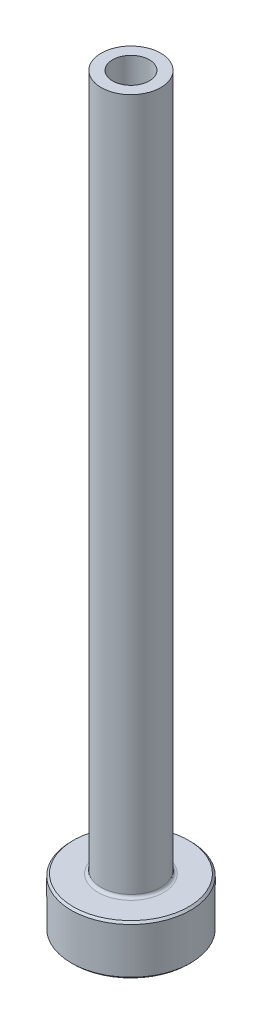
ISO-10303-21;
HEADER;
FILE_DESCRIPTION(('STEP AP214'),'2;1');
FILE_NAME('part.step','',(''),(''),'','','');
FILE_SCHEMA(('AUTOMOTIVE_DESIGN { 1 0 10303 214 1 1 1 1 }'));
ENDSEC;
DATA;
#1=APPLICATION_CONTEXT('core data for automotive mechanical design processes');
#2=APPLICATION_PROTOCOL_DEFINITION('international standard','automotive_design',2000,#1);
#3=PRODUCT_CONTEXT('',#1,'mechanical');
#4=PRODUCT('Part','Part','',(#3));
#5=PRODUCT_RELATED_PRODUCT_CATEGORY('part','',(#4));
#6=PRODUCT_DEFINITION_FORMATION('','',#4);
#7=PRODUCT_DEFINITION_CONTEXT('part definition',#1,'design');
#8=PRODUCT_DEFINITION('design','',#6,#7);
#9=PRODUCT_DEFINITION_SHAPE('','',#8);
#10=(LENGTH_UNIT() NAMED_UNIT(*) SI_UNIT(.MILLI.,.METRE.));
#11=(NAMED_UNIT(*) PLANE_ANGLE_UNIT() SI_UNIT($,.RADIAN.));
#12=(NAMED_UNIT(*) SI_UNIT($,.STERADIAN.) SOLID_ANGLE_UNIT());
#13=UNCERTAINTY_MEASURE_WITH_UNIT(LENGTH_MEASURE(1.E-05),#10,'distance_accuracy_value','');
#14=(GEOMETRIC_REPRESENTATION_CONTEXT(3) GLOBAL_UNCERTAINTY_ASSIGNED_CONTEXT((#13)) GLOBAL_UNIT_ASSIGNED_CONTEXT((#10,
#11,#12)) REPRESENTATION_CONTEXT('',''));
#15=CARTESIAN_POINT('',(0.,0.,0.));
#16=DIRECTION('',(0.,0.,1.));
#17=DIRECTION('',(1.,0.,0.));
#18=AXIS2_PLACEMENT_3D('',#15,#16,#17);
#19=CARTESIAN_POINT('',(0.,92.1876809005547,0.));
#20=DIRECTION('',(0.,1.,0.));
#21=DIRECTION('',(0.,0.,1.));
#22=AXIS2_PLACEMENT_3D('',#19,#20,#21);
#23=CYLINDRICAL_SURFACE('',#22,1.85000000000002);
#24=CARTESIAN_POINT('',(0.,75.,0.));
#25=DIRECTION('',(0.,1.,0.));
#26=DIRECTION('',(0.,0.,1.));
#27=AXIS2_PLACEMENT_3D('',#24,#25,#26);
#28=CIRCLE('',#27,1.85000000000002);
#29=CARTESIAN_POINT('',(0.,75.,1.85000000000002));
#30=VERTEX_POINT('',#29);
#31=EDGE_CURVE('E62',#30,#30,#28,.T.);
#32=ORIENTED_EDGE('',*,*,#31,.T.);
#33=EDGE_LOOP('',(#32));
#34=FACE_BOUND('',#33,.T.);
#35=CARTESIAN_POINT('',(0.,30.,0.));
#36=DIRECTION('',(0.,1.,0.));
#37=DIRECTION('',(0.,0.,1.));
#38=AXIS2_PLACEMENT_3D('',#35,#36,#37);
#39=CIRCLE('',#38,1.85000000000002);
#40=CARTESIAN_POINT('',(0.,30.,1.85000000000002));
#41=VERTEX_POINT('',#40);
#42=EDGE_CURVE('E71',#41,#41,#39,.T.);
#43=ORIENTED_EDGE('',*,*,#42,.F.);
#44=EDGE_LOOP('',(#43));
#45=FACE_BOUND('',#44,.T.);
#46=ADVANCED_FACE('F30',(#34,#45),#23,.F.);
#47=CARTESIAN_POINT('',(-1.85000000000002,75.,0.));
#48=DIRECTION('',(0.,1.,0.));
#49=DIRECTION('',(0.,0.,1.));
#50=AXIS2_PLACEMENT_3D('',#47,#48,#49);
#51=PLANE('',#50);
#52=CARTESIAN_POINT('',(0.,75.,0.));
#53=DIRECTION('',(0.,1.,0.));
#54=DIRECTION('',(0.,0.,1.));
#55=AXIS2_PLACEMENT_3D('',#52,#53,#54);
#56=CIRCLE('',#55,3.);
#57=CARTESIAN_POINT('',(0.,75.,3.));
#58=VERTEX_POINT('',#57);
#59=EDGE_CURVE('E65',#58,#58,#56,.T.);
#60=ORIENTED_EDGE('',*,*,#59,.T.);
#61=EDGE_LOOP('',(#60));
#62=FACE_BOUND('',#61,.T.);
#63=ORIENTED_EDGE('',*,*,#31,.F.);
#64=EDGE_LOOP('',(#63));
#65=FACE_BOUND('',#64,.T.);
#66=ADVANCED_FACE('F79',(#62,#65),#51,.T.);
#67=CARTESIAN_POINT('',(0.,92.1876809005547,0.));
#68=DIRECTION('',(0.,1.,0.));
#69=DIRECTION('',(0.,0.,1.));
#70=AXIS2_PLACEMENT_3D('',#67,#68,#69);
#71=CYLINDRICAL_SURFACE('',#70,2.99999999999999);
#72=CARTESIAN_POINT('',(0.,5.3,0.));
#73=DIRECTION('',(0.,1.,0.));
#74=DIRECTION('',(0.,0.,1.));
#75=AXIS2_PLACEMENT_3D('',#72,#73,#74);
#76=CIRCLE('',#75,2.99999999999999);
#77=CARTESIAN_POINT('',(0.,5.3,2.99999999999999));
#78=VERTEX_POINT('',#77);
#79=EDGE_CURVE('E59',#78,#78,#76,.T.);
#80=ORIENTED_EDGE('',*,*,#79,.T.);
#81=EDGE_LOOP('',(#80));
#82=FACE_BOUND('',#81,.T.);
#83=ORIENTED_EDGE('',*,*,#59,.F.);
#84=EDGE_LOOP('',(#83));
#85=FACE_BOUND('',#84,.T.);
#86=ADVANCED_FACE('F85',(#82,#85),#71,.T.);
#87=CARTESIAN_POINT('',(-2.99999999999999,5.,0.));
#88=DIRECTION('',(0.,1.,0.));
#89=DIRECTION('',(0.,0.,1.));
#90=AXIS2_PLACEMENT_3D('',#87,#88,#89);
#91=PLANE('',#90);
#92=CARTESIAN_POINT('',(0.,5.,0.));
#93=DIRECTION('',(0.,1.,0.));
#94=DIRECTION('',(0.,0.,1.));
#95=AXIS2_PLACEMENT_3D('',#92,#93,#94);
#96=CIRCLE('',#95,5.80000000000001);
#97=CARTESIAN_POINT('',(0.,5.,5.80000000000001));
#98=VERTEX_POINT('',#97);
#99=EDGE_CURVE('E53',#98,#98,#96,.T.);
#100=ORIENTED_EDGE('',*,*,#99,.T.);
#101=EDGE_LOOP('',(#100));
#102=FACE_BOUND('',#101,.T.);
#103=CARTESIAN_POINT('',(0.,5.,0.));
#104=DIRECTION('',(0.,1.,0.));
#105=DIRECTION('',(0.,0.,1.));
#106=AXIS2_PLACEMENT_3D('',#103,#104,#105);
#107=CIRCLE('',#106,3.29999999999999);
#108=CARTESIAN_POINT('',(0.,5.,3.29999999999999));
#109=VERTEX_POINT('',#108);
#110=EDGE_CURVE('E56',#109,#109,#107,.F.);
#111=ORIENTED_EDGE('',*,*,#110,.T.);
#112=EDGE_LOOP('',(#111));
#113=FACE_BOUND('',#112,.T.);
#114=ADVANCED_FACE('F111',(#102,#113),#91,.T.);
#115=CARTESIAN_POINT('',(0.,92.1876809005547,0.));
#116=DIRECTION('',(0.,1.,0.));
#117=DIRECTION('',(0.,0.,1.));
#118=AXIS2_PLACEMENT_3D('',#115,#116,#117);
#119=CYLINDRICAL_SURFACE('',#118,5.99999999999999);
#120=CARTESIAN_POINT('',(0.,4.8,0.));
#121=DIRECTION('',(0.,1.,0.));
#122=DIRECTION('',(0.,0.,1.));
#123=AXIS2_PLACEMENT_3D('',#120,#121,#122);
#124=CIRCLE('',#123,5.99999999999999);
#125=CARTESIAN_POINT('',(0.,4.8,5.99999999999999));
#126=VERTEX_POINT('',#125);
#127=EDGE_CURVE('E45',#126,#126,#124,.F.);
#128=ORIENTED_EDGE('',*,*,#127,.T.);
#129=EDGE_LOOP('',(#128));
#130=FACE_BOUND('',#129,.T.);
#131=CARTESIAN_POINT('',(0.,0.199999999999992,0.));
#132=DIRECTION('',(0.,-1.,0.));
#133=DIRECTION('',(0.,0.,-1.));
#134=AXIS2_PLACEMENT_3D('',#131,#132,#133);
#135=CIRCLE('',#134,5.99999999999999);
#136=CARTESIAN_POINT('',(0.,0.199999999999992,-5.99999999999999));
#137=VERTEX_POINT('',#136);
#138=EDGE_CURVE('E50',#137,#137,#135,.F.);
#139=ORIENTED_EDGE('',*,*,#138,.T.);
#140=EDGE_LOOP('',(#139));
#141=FACE_BOUND('',#140,.T.);
#142=ADVANCED_FACE('F108',(#130,#141),#119,.T.);
#143=CARTESIAN_POINT('',(-5.99999999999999,0.,0.));
#144=DIRECTION('',(0.,-1.,0.));
#145=DIRECTION('',(0.,0.,-1.));
#146=AXIS2_PLACEMENT_3D('',#143,#144,#145);
#147=PLANE('',#146);
#148=CARTESIAN_POINT('',(0.,0.,0.));
#149=DIRECTION('',(0.,-1.,0.));
#150=DIRECTION('',(0.,0.,-1.));
#151=AXIS2_PLACEMENT_3D('',#148,#149,#150);
#152=CIRCLE('',#151,2.59999999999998);
#153=CARTESIAN_POINT('',(0.,0.,-2.59999999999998));
#154=VERTEX_POINT('',#153);
#155=EDGE_CURVE('E37',#154,#154,#152,.F.);
#156=ORIENTED_EDGE('',*,*,#155,.T.);
#157=EDGE_LOOP('',(#156));
#158=FACE_BOUND('',#157,.T.);
#159=CARTESIAN_POINT('',(0.,0.,0.));
#160=DIRECTION('',(0.,-1.,0.));
#161=DIRECTION('',(0.,0.,-1.));
#162=AXIS2_PLACEMENT_3D('',#159,#160,#161);
#163=CIRCLE('',#162,5.79999999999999);
#164=CARTESIAN_POINT('',(0.,0.,-5.79999999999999));
#165=VERTEX_POINT('',#164);
#166=EDGE_CURVE('E41',#165,#165,#163,.T.);
#167=ORIENTED_EDGE('',*,*,#166,.T.);
#168=EDGE_LOOP('',(#167));
#169=FACE_BOUND('',#168,.T.);
#170=ADVANCED_FACE('F110',(#158,#169),#147,.T.);
#171=CARTESIAN_POINT('',(0.,92.1876809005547,0.));
#172=DIRECTION('',(0.,1.,0.));
#173=DIRECTION('',(0.,0.,1.));
#174=AXIS2_PLACEMENT_3D('',#171,#172,#173);
#175=CYLINDRICAL_SURFACE('',#174,2.09999999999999);
#176=CARTESIAN_POINT('',(0.,0.5,0.));
#177=DIRECTION('',(0.,-1.,0.));
#178=DIRECTION('',(0.,0.,-1.));
#179=AXIS2_PLACEMENT_3D('',#176,#177,#178);
#180=CIRCLE('',#179,2.09999999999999);
#181=CARTESIAN_POINT('',(0.,0.5,-2.09999999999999));
#182=VERTEX_POINT('',#181);
#183=EDGE_CURVE('E10',#182,#182,#180,.T.);
#184=ORIENTED_EDGE('',*,*,#183,.T.);
#185=EDGE_LOOP('',(#184));
#186=FACE_BOUND('',#185,.T.);
#187=CARTESIAN_POINT('',(0.,18.,0.));
#188=DIRECTION('',(0.,1.,0.));
#189=DIRECTION('',(0.,0.,1.));
#190=AXIS2_PLACEMENT_3D('',#187,#188,#189);
#191=CIRCLE('',#190,2.09999999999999);
#192=CARTESIAN_POINT('',(0.,18.,2.09999999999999));
#193=VERTEX_POINT('',#192);
#194=EDGE_CURVE('E68',#193,#193,#191,.T.);
#195=ORIENTED_EDGE('',*,*,#194,.T.);
#196=EDGE_LOOP('',(#195));
#197=FACE_BOUND('',#196,.T.);
#198=ADVANCED_FACE('F118',(#186,#197),#175,.F.);
#199=CARTESIAN_POINT('',(0.,18.,0.));
#200=DIRECTION('',(0.,-1.,0.));
#201=DIRECTION('',(0.,0.,-1.));
#202=AXIS2_PLACEMENT_3D('',#199,#200,#201);
#203=CONICAL_SURFACE('',#202,2.09999999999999,0.020830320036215);
#204=ORIENTED_EDGE('',*,*,#42,.T.);
#205=EDGE_LOOP('',(#204));
#206=FACE_BOUND('',#205,.T.);
#207=ORIENTED_EDGE('',*,*,#194,.F.);
#208=EDGE_LOOP('',(#207));
#209=FACE_BOUND('',#208,.T.);
#210=ADVANCED_FACE('F75',(#206,#209),#203,.F.);
#211=CARTESIAN_POINT('',(0.,5.3,0.));
#212=DIRECTION('',(0.,1.,0.));
#213=DIRECTION('',(0.,0.,1.));
#214=AXIS2_PLACEMENT_3D('',#211,#212,#213);
#215=TOROIDAL_SURFACE('',#214,3.29999999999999,0.3);
#216=ORIENTED_EDGE('',*,*,#110,.F.);
#217=EDGE_LOOP('',(#216));
#218=FACE_BOUND('',#217,.T.);
#219=ORIENTED_EDGE('',*,*,#79,.F.);
#220=EDGE_LOOP('',(#219));
#221=FACE_BOUND('',#220,.T.);
#222=ADVANCED_FACE('F90',(#218,#221),#215,.F.);
#223=CARTESIAN_POINT('',(0.,5.,0.));
#224=DIRECTION('',(0.,-1.,0.));
#225=DIRECTION('',(0.,0.,-1.));
#226=AXIS2_PLACEMENT_3D('',#223,#224,#225);
#227=CONICAL_SURFACE('',#226,5.8,0.785398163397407);
#228=ORIENTED_EDGE('',*,*,#127,.F.);
#229=EDGE_LOOP('',(#228));
#230=FACE_BOUND('',#229,.T.);
#231=ORIENTED_EDGE('',*,*,#99,.F.);
#232=EDGE_LOOP('',(#231));
#233=FACE_BOUND('',#232,.T.);
#234=ADVANCED_FACE('F93',(#230,#233),#227,.T.);
#235=CARTESIAN_POINT('',(0.,0.199999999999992,0.));
#236=DIRECTION('',(0.,1.,0.));
#237=DIRECTION('',(0.,0.,1.));
#238=AXIS2_PLACEMENT_3D('',#235,#236,#237);
#239=CONICAL_SURFACE('',#238,5.99999999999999,0.785398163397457);
#240=ORIENTED_EDGE('',*,*,#166,.F.);
#241=EDGE_LOOP('',(#240));
#242=FACE_BOUND('',#241,.T.);
#243=ORIENTED_EDGE('',*,*,#138,.F.);
#244=EDGE_LOOP('',(#243));
#245=FACE_BOUND('',#244,.T.);
#246=ADVANCED_FACE('F96',(#242,#245),#239,.T.);
#247=CARTESIAN_POINT('',(0.,0.,0.));
#248=DIRECTION('',(0.,-1.,0.));
#249=DIRECTION('',(0.,0.,-1.));
#250=AXIS2_PLACEMENT_3D('',#247,#248,#249);
#251=CONICAL_SURFACE('',#250,2.59999999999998,0.785398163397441);
#252=ORIENTED_EDGE('',*,*,#183,.F.);
#253=EDGE_LOOP('',(#252));
#254=FACE_BOUND('',#253,.T.);
#255=ORIENTED_EDGE('',*,*,#155,.F.);
#256=EDGE_LOOP('',(#255));
#257=FACE_BOUND('',#256,.T.);
#258=ADVANCED_FACE('F32',(#254,#257),#251,.F.);
#259=CLOSED_SHELL('',(#46,#66,#86,#114,#142,#170,#198,#210,#222,#234,#246,#258));
#260=MANIFOLD_SOLID_BREP('B2',#259);
#261=ADVANCED_BREP_SHAPE_REPRESENTATION('',(#18,#260),#14);
#262=SHAPE_DEFINITION_REPRESENTATION(#9,#261);
ENDSEC;
END-ISO-10303-21;
